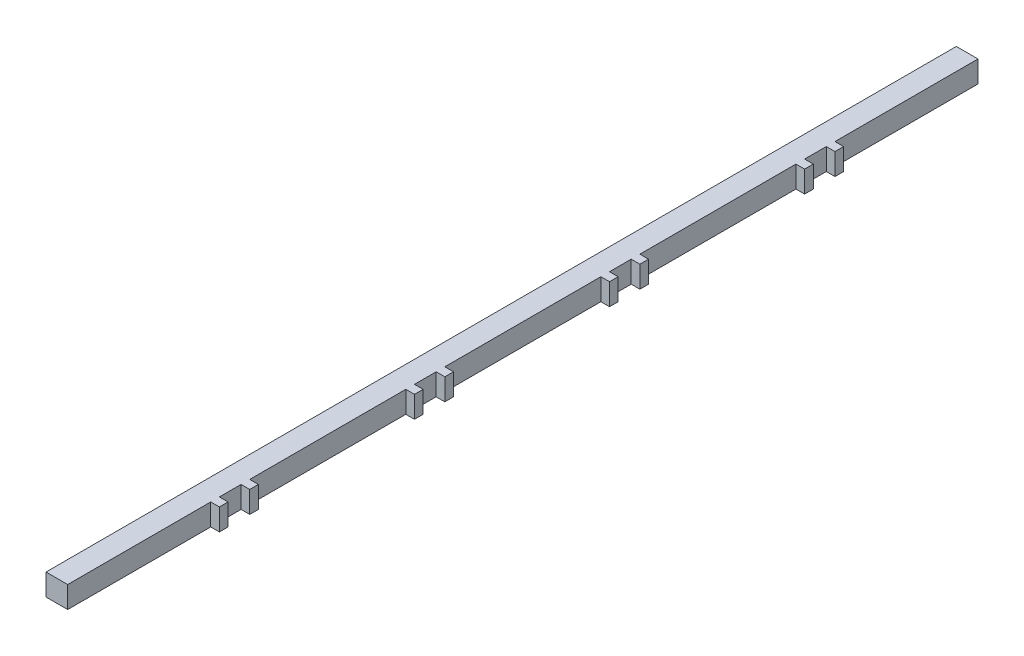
ISO-10303-21;
HEADER;
FILE_DESCRIPTION(('STEP AP214'),'2;1');
FILE_NAME('part.step','',(''),(''),'','','');
FILE_SCHEMA(('AUTOMOTIVE_DESIGN { 1 0 10303 214 1 1 1 1 }'));
ENDSEC;
DATA;
#1=APPLICATION_CONTEXT('core data for automotive mechanical design processes');
#2=APPLICATION_PROTOCOL_DEFINITION('international standard','automotive_design',2000,#1);
#3=PRODUCT_CONTEXT('',#1,'mechanical');
#4=PRODUCT('Part','Part','',(#3));
#5=PRODUCT_RELATED_PRODUCT_CATEGORY('part','',(#4));
#6=PRODUCT_DEFINITION_FORMATION('','',#4);
#7=PRODUCT_DEFINITION_CONTEXT('part definition',#1,'design');
#8=PRODUCT_DEFINITION('design','',#6,#7);
#9=PRODUCT_DEFINITION_SHAPE('','',#8);
#10=(LENGTH_UNIT() NAMED_UNIT(*) SI_UNIT(.MILLI.,.METRE.));
#11=(NAMED_UNIT(*) PLANE_ANGLE_UNIT() SI_UNIT($,.RADIAN.));
#12=(NAMED_UNIT(*) SI_UNIT($,.STERADIAN.) SOLID_ANGLE_UNIT());
#13=UNCERTAINTY_MEASURE_WITH_UNIT(LENGTH_MEASURE(1.E-05),#10,'distance_accuracy_value','');
#14=(GEOMETRIC_REPRESENTATION_CONTEXT(3) GLOBAL_UNCERTAINTY_ASSIGNED_CONTEXT((#13)) GLOBAL_UNIT_ASSIGNED_CONTEXT((#10,
#11,#12)) REPRESENTATION_CONTEXT('',''));
#15=CARTESIAN_POINT('',(0.,0.,0.));
#16=DIRECTION('',(0.,0.,1.));
#17=DIRECTION('',(1.,0.,0.));
#18=AXIS2_PLACEMENT_3D('',#15,#16,#17);
#19=CARTESIAN_POINT('',(0.,6.35,279.4));
#20=DIRECTION('',(-1.,0.,0.));
#21=DIRECTION('',(0.,0.,1.));
#22=AXIS2_PLACEMENT_3D('',#19,#20,#21);
#23=PLANE('',#22);
#24=DIRECTION('',(0.,-1.,0.));
#25=VECTOR('',#24,1.);
#26=CARTESIAN_POINT('',(0.,6.35,50.8));
#27=LINE('',#26,#25);
#28=CARTESIAN_POINT('',(0.,6.35,50.8));
#29=VERTEX_POINT('',#28);
#30=CARTESIAN_POINT('',(0.,0.,50.8));
#31=VERTEX_POINT('',#30);
#32=EDGE_CURVE('E599',#29,#31,#27,.T.);
#33=ORIENTED_EDGE('',*,*,#32,.F.);
#34=DIRECTION('',(0.,0.,-1.));
#35=VECTOR('',#34,1.);
#36=CARTESIAN_POINT('',(0.,6.35,279.4));
#37=LINE('',#36,#35);
#38=CARTESIAN_POINT('',(0.,6.35,57.15));
#39=VERTEX_POINT('',#38);
#40=EDGE_CURVE('E332',#39,#29,#37,.T.);
#41=ORIENTED_EDGE('',*,*,#40,.F.);
#42=DIRECTION('',(0.,1.,0.));
#43=VECTOR('',#42,1.);
#44=CARTESIAN_POINT('',(0.,0.,57.15));
#45=LINE('',#44,#43);
#46=CARTESIAN_POINT('',(0.,0.,57.15));
#47=VERTEX_POINT('',#46);
#48=EDGE_CURVE('E550',#47,#39,#45,.T.);
#49=ORIENTED_EDGE('',*,*,#48,.F.);
#50=DIRECTION('',(0.,0.,-1.));
#51=VECTOR('',#50,1.);
#52=CARTESIAN_POINT('',(0.,0.,279.4));
#53=LINE('',#52,#51);
#54=EDGE_CURVE('E310',#47,#31,#53,.T.);
#55=ORIENTED_EDGE('',*,*,#54,.T.);
#56=EDGE_LOOP('',(#33,#41,#49,#55));
#57=FACE_BOUND('',#56,.T.);
#58=ADVANCED_FACE('F45',(#57),#23,.F.);
#59=CARTESIAN_POINT('',(0.,0.,48.2600000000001));
#60=VERTEX_POINT('',#59);
#61=CARTESIAN_POINT('',(0.,0.,6.35));
#62=VERTEX_POINT('',#61);
#63=EDGE_CURVE('E301',#60,#62,#53,.T.);
#64=ORIENTED_EDGE('',*,*,#63,.T.);
#65=DIRECTION('',(0.,1.,0.));
#66=VECTOR('',#65,1.);
#67=CARTESIAN_POINT('',(0.,0.,6.35));
#68=LINE('',#67,#66);
#69=CARTESIAN_POINT('',(0.,6.35,6.35));
#70=VERTEX_POINT('',#69);
#71=EDGE_CURVE('E634',#62,#70,#68,.T.);
#72=ORIENTED_EDGE('',*,*,#71,.T.);
#73=CARTESIAN_POINT('',(0.,6.35,48.2600000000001));
#74=VERTEX_POINT('',#73);
#75=EDGE_CURVE('E322',#74,#70,#37,.T.);
#76=ORIENTED_EDGE('',*,*,#75,.F.);
#77=DIRECTION('',(0.,-1.,0.));
#78=VECTOR('',#77,1.);
#79=CARTESIAN_POINT('',(0.,6.35,48.2600000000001));
#80=LINE('',#79,#78);
#81=EDGE_CURVE('E594',#74,#60,#80,.T.);
#82=ORIENTED_EDGE('',*,*,#81,.T.);
#83=EDGE_LOOP('',(#64,#72,#76,#82));
#84=FACE_BOUND('',#83,.T.);
#85=ADVANCED_FACE('F646',(#84),#23,.F.);
#86=DIRECTION('',(0.,-1.,0.));
#87=VECTOR('',#86,1.);
#88=CARTESIAN_POINT('',(0.,6.35,107.95));
#89=LINE('',#88,#87);
#90=CARTESIAN_POINT('',(0.,6.35,107.95));
#91=VERTEX_POINT('',#90);
#92=CARTESIAN_POINT('',(0.,0.,107.95));
#93=VERTEX_POINT('',#92);
#94=EDGE_CURVE('E529',#91,#93,#89,.T.);
#95=ORIENTED_EDGE('',*,*,#94,.F.);
#96=CARTESIAN_POINT('',(0.,6.35,114.3));
#97=VERTEX_POINT('',#96);
#98=EDGE_CURVE('E744',#97,#91,#37,.T.);
#99=ORIENTED_EDGE('',*,*,#98,.F.);
#100=DIRECTION('',(0.,1.,0.));
#101=VECTOR('',#100,1.);
#102=CARTESIAN_POINT('',(0.,0.,114.3));
#103=LINE('',#102,#101);
#104=CARTESIAN_POINT('',(0.,0.,114.3));
#105=VERTEX_POINT('',#104);
#106=EDGE_CURVE('E480',#105,#97,#103,.T.);
#107=ORIENTED_EDGE('',*,*,#106,.F.);
#108=EDGE_CURVE('E683',#105,#93,#53,.T.);
#109=ORIENTED_EDGE('',*,*,#108,.T.);
#110=EDGE_LOOP('',(#95,#99,#107,#109));
#111=FACE_BOUND('',#110,.T.);
#112=ADVANCED_FACE('F774',(#111),#23,.F.);
#113=CARTESIAN_POINT('',(0.,0.,105.41));
#114=VERTEX_POINT('',#113);
#115=CARTESIAN_POINT('',(0.,0.,59.69));
#116=VERTEX_POINT('',#115);
#117=EDGE_CURVE('E320',#114,#116,#53,.T.);
#118=ORIENTED_EDGE('',*,*,#117,.T.);
#119=DIRECTION('',(0.,1.,0.));
#120=VECTOR('',#119,1.);
#121=CARTESIAN_POINT('',(0.,0.,59.69));
#122=LINE('',#121,#120);
#123=CARTESIAN_POINT('',(0.,6.35,59.69));
#124=VERTEX_POINT('',#123);
#125=EDGE_CURVE('E564',#116,#124,#122,.T.);
#126=ORIENTED_EDGE('',*,*,#125,.T.);
#127=CARTESIAN_POINT('',(0.,6.35,105.41));
#128=VERTEX_POINT('',#127);
#129=EDGE_CURVE('E341',#128,#124,#37,.T.);
#130=ORIENTED_EDGE('',*,*,#129,.F.);
#131=DIRECTION('',(0.,-1.,0.));
#132=VECTOR('',#131,1.);
#133=CARTESIAN_POINT('',(0.,6.35,105.41));
#134=LINE('',#133,#132);
#135=EDGE_CURVE('E524',#128,#114,#134,.T.);
#136=ORIENTED_EDGE('',*,*,#135,.T.);
#137=EDGE_LOOP('',(#118,#126,#130,#136));
#138=FACE_BOUND('',#137,.T.);
#139=ADVANCED_FACE('F757',(#138),#23,.F.);
#140=DIRECTION('',(0.,-1.,0.));
#141=VECTOR('',#140,1.);
#142=CARTESIAN_POINT('',(0.,6.35,165.1));
#143=LINE('',#142,#141);
#144=CARTESIAN_POINT('',(0.,6.35,165.1));
#145=VERTEX_POINT('',#144);
#146=CARTESIAN_POINT('',(0.,0.,165.1));
#147=VERTEX_POINT('',#146);
#148=EDGE_CURVE('E459',#145,#147,#143,.T.);
#149=ORIENTED_EDGE('',*,*,#148,.F.);
#150=CARTESIAN_POINT('',(0.,6.35,171.45));
#151=VERTEX_POINT('',#150);
#152=EDGE_CURVE('E735',#151,#145,#37,.T.);
#153=ORIENTED_EDGE('',*,*,#152,.F.);
#154=DIRECTION('',(0.,1.,0.));
#155=VECTOR('',#154,1.);
#156=CARTESIAN_POINT('',(0.,0.,171.45));
#157=LINE('',#156,#155);
#158=CARTESIAN_POINT('',(0.,0.,171.45));
#159=VERTEX_POINT('',#158);
#160=EDGE_CURVE('E419',#159,#151,#157,.T.);
#161=ORIENTED_EDGE('',*,*,#160,.F.);
#162=EDGE_CURVE('E697',#159,#147,#53,.T.);
#163=ORIENTED_EDGE('',*,*,#162,.T.);
#164=EDGE_LOOP('',(#149,#153,#161,#163));
#165=FACE_BOUND('',#164,.T.);
#166=ADVANCED_FACE('F736',(#165),#23,.F.);
#167=CARTESIAN_POINT('',(0.,0.,162.56));
#168=VERTEX_POINT('',#167);
#169=CARTESIAN_POINT('',(0.,0.,116.84));
#170=VERTEX_POINT('',#169);
#171=EDGE_CURVE('E688',#168,#170,#53,.T.);
#172=ORIENTED_EDGE('',*,*,#171,.T.);
#173=DIRECTION('',(0.,1.,0.));
#174=VECTOR('',#173,1.);
#175=CARTESIAN_POINT('',(0.,0.,116.84));
#176=LINE('',#175,#174);
#177=CARTESIAN_POINT('',(0.,6.35,116.84));
#178=VERTEX_POINT('',#177);
#179=EDGE_CURVE('E494',#170,#178,#176,.T.);
#180=ORIENTED_EDGE('',*,*,#179,.T.);
#181=CARTESIAN_POINT('',(0.,6.35,162.56));
#182=VERTEX_POINT('',#181);
#183=EDGE_CURVE('E738',#182,#178,#37,.T.);
#184=ORIENTED_EDGE('',*,*,#183,.F.);
#185=DIRECTION('',(0.,-1.,0.));
#186=VECTOR('',#185,1.);
#187=CARTESIAN_POINT('',(0.,6.35,162.56));
#188=LINE('',#187,#186);
#189=EDGE_CURVE('E454',#182,#168,#188,.T.);
#190=ORIENTED_EDGE('',*,*,#189,.T.);
#191=EDGE_LOOP('',(#172,#180,#184,#190));
#192=FACE_BOUND('',#191,.T.);
#193=ADVANCED_FACE('F797',(#192),#23,.F.);
#194=DIRECTION('',(0.,-1.,0.));
#195=VECTOR('',#194,1.);
#196=CARTESIAN_POINT('',(0.,6.35,222.25));
#197=LINE('',#196,#195);
#198=CARTESIAN_POINT('',(0.,6.35,222.25));
#199=VERTEX_POINT('',#198);
#200=CARTESIAN_POINT('',(0.,0.,222.25));
#201=VERTEX_POINT('',#200);
#202=EDGE_CURVE('E388',#199,#201,#197,.T.);
#203=ORIENTED_EDGE('',*,*,#202,.F.);
#204=CARTESIAN_POINT('',(0.,6.35,228.6));
#205=VERTEX_POINT('',#204);
#206=EDGE_CURVE('E321',#205,#199,#37,.T.);
#207=ORIENTED_EDGE('',*,*,#206,.F.);
#208=DIRECTION('',(0.,1.,0.));
#209=VECTOR('',#208,1.);
#210=CARTESIAN_POINT('',(0.,0.,228.6));
#211=LINE('',#210,#209);
#212=CARTESIAN_POINT('',(0.,0.,228.6));
#213=VERTEX_POINT('',#212);
#214=EDGE_CURVE('E367',#213,#205,#211,.T.);
#215=ORIENTED_EDGE('',*,*,#214,.F.);
#216=EDGE_CURVE('E300',#213,#201,#53,.T.);
#217=ORIENTED_EDGE('',*,*,#216,.T.);
#218=EDGE_LOOP('',(#203,#207,#215,#217));
#219=FACE_BOUND('',#218,.T.);
#220=ADVANCED_FACE('F792',(#219),#23,.F.);
#221=CARTESIAN_POINT('',(0.,0.,219.71));
#222=VERTEX_POINT('',#221);
#223=CARTESIAN_POINT('',(0.,0.,173.99));
#224=VERTEX_POINT('',#223);
#225=EDGE_CURVE('E306',#222,#224,#53,.T.);
#226=ORIENTED_EDGE('',*,*,#225,.T.);
#227=DIRECTION('',(0.,1.,0.));
#228=VECTOR('',#227,1.);
#229=CARTESIAN_POINT('',(0.,0.,173.99));
#230=LINE('',#229,#228);
#231=CARTESIAN_POINT('',(0.,6.35,173.99));
#232=VERTEX_POINT('',#231);
#233=EDGE_CURVE('E424',#224,#232,#230,.T.);
#234=ORIENTED_EDGE('',*,*,#233,.T.);
#235=CARTESIAN_POINT('',(0.,6.35,219.71));
#236=VERTEX_POINT('',#235);
#237=EDGE_CURVE('E328',#236,#232,#37,.T.);
#238=ORIENTED_EDGE('',*,*,#237,.F.);
#239=DIRECTION('',(0.,-1.,0.));
#240=VECTOR('',#239,1.);
#241=CARTESIAN_POINT('',(0.,6.35,219.71));
#242=LINE('',#241,#240);
#243=EDGE_CURVE('E371',#236,#222,#242,.T.);
#244=ORIENTED_EDGE('',*,*,#243,.T.);
#245=EDGE_LOOP('',(#226,#234,#238,#244));
#246=FACE_BOUND('',#245,.T.);
#247=ADVANCED_FACE('F716',(#246),#23,.F.);
#248=CARTESIAN_POINT('',(-6.35,6.35,279.4));
#249=DIRECTION('',(1.,0.,0.));
#250=DIRECTION('',(0.,0.,-1.));
#251=AXIS2_PLACEMENT_3D('',#248,#249,#250);
#252=PLANE('',#251);
#253=DIRECTION('',(0.,0.,-1.));
#254=VECTOR('',#253,1.);
#255=CARTESIAN_POINT('',(-6.35,0.,279.4));
#256=LINE('',#255,#254);
#257=CARTESIAN_POINT('',(-6.35,0.,273.05));
#258=VERTEX_POINT('',#257);
#259=CARTESIAN_POINT('',(-6.35,0.,6.35));
#260=VERTEX_POINT('',#259);
#261=EDGE_CURVE('E11',#258,#260,#256,.T.);
#262=ORIENTED_EDGE('',*,*,#261,.F.);
#263=DIRECTION('',(0.,1.,0.));
#264=VECTOR('',#263,1.);
#265=CARTESIAN_POINT('',(-6.35,0.,273.05));
#266=LINE('',#265,#264);
#267=CARTESIAN_POINT('',(-6.35,6.35,273.05));
#268=VERTEX_POINT('',#267);
#269=EDGE_CURVE('E280',#258,#268,#266,.T.);
#270=ORIENTED_EDGE('',*,*,#269,.T.);
#271=DIRECTION('',(0.,0.,-1.));
#272=VECTOR('',#271,1.);
#273=CARTESIAN_POINT('',(-6.35,6.35,279.4));
#274=LINE('',#273,#272);
#275=CARTESIAN_POINT('',(-6.35,6.35,6.35000000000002));
#276=VERTEX_POINT('',#275);
#277=EDGE_CURVE('E333',#268,#276,#274,.T.);
#278=ORIENTED_EDGE('',*,*,#277,.T.);
#279=DIRECTION('',(0.,1.,0.));
#280=VECTOR('',#279,1.);
#281=CARTESIAN_POINT('',(-6.35,0.,6.35));
#282=LINE('',#281,#280);
#283=EDGE_CURVE('E69',#260,#276,#282,.T.);
#284=ORIENTED_EDGE('',*,*,#283,.F.);
#285=EDGE_LOOP('',(#262,#270,#278,#284));
#286=FACE_BOUND('',#285,.T.);
#287=ADVANCED_FACE('F47',(#286),#252,.F.);
#288=CARTESIAN_POINT('',(0.,0.,279.4));
#289=DIRECTION('',(0.,1.,0.));
#290=DIRECTION('',(-1.,0.,0.));
#291=AXIS2_PLACEMENT_3D('',#288,#289,#290);
#292=PLANE('',#291);
#293=CARTESIAN_POINT('',(0.,0.,273.05));
#294=VERTEX_POINT('',#293);
#295=CARTESIAN_POINT('',(0.,0.,231.14));
#296=VERTEX_POINT('',#295);
#297=EDGE_CURVE('E54',#294,#296,#53,.T.);
#298=ORIENTED_EDGE('',*,*,#297,.F.);
#299=DIRECTION('',(-1.,0.,0.));
#300=VECTOR('',#299,1.);
#301=CARTESIAN_POINT('',(-6.35,0.,273.05));
#302=LINE('',#301,#300);
#303=EDGE_CURVE('E277',#294,#258,#302,.T.);
#304=ORIENTED_EDGE('',*,*,#303,.T.);
#305=ORIENTED_EDGE('',*,*,#261,.T.);
#306=DIRECTION('',(1.,0.,0.));
#307=VECTOR('',#306,1.);
#308=CARTESIAN_POINT('',(-6.35,0.,6.35));
#309=LINE('',#308,#307);
#310=EDGE_CURVE('E627',#260,#62,#309,.T.);
#311=ORIENTED_EDGE('',*,*,#310,.T.);
#312=ORIENTED_EDGE('',*,*,#63,.F.);
#313=DIRECTION('',(-1.,0.,0.));
#314=VECTOR('',#313,1.);
#315=CARTESIAN_POINT('',(2.54,0.,48.2600000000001));
#316=LINE('',#315,#314);
#317=CARTESIAN_POINT('',(2.54,0.,48.2600000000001));
#318=VERTEX_POINT('',#317);
#319=EDGE_CURVE('E622',#318,#60,#316,.T.);
#320=ORIENTED_EDGE('',*,*,#319,.F.);
#321=DIRECTION('',(0.,0.,-1.));
#322=VECTOR('',#321,1.);
#323=CARTESIAN_POINT('',(2.54,0.,50.8));
#324=LINE('',#323,#322);
#325=CARTESIAN_POINT('',(2.54,0.,50.8));
#326=VERTEX_POINT('',#325);
#327=EDGE_CURVE('E604',#326,#318,#324,.T.);
#328=ORIENTED_EDGE('',*,*,#327,.F.);
#329=DIRECTION('',(-1.,0.,0.));
#330=VECTOR('',#329,1.);
#331=CARTESIAN_POINT('',(2.54,0.,50.8));
#332=LINE('',#331,#330);
#333=EDGE_CURVE('E618',#326,#31,#332,.T.);
#334=ORIENTED_EDGE('',*,*,#333,.T.);
#335=ORIENTED_EDGE('',*,*,#54,.F.);
#336=DIRECTION('',(-1.,0.,0.));
#337=VECTOR('',#336,1.);
#338=CARTESIAN_POINT('',(2.54,0.,57.15));
#339=LINE('',#338,#337);
#340=CARTESIAN_POINT('',(2.54,0.,57.15));
#341=VERTEX_POINT('',#340);
#342=EDGE_CURVE('E591',#341,#47,#339,.T.);
#343=ORIENTED_EDGE('',*,*,#342,.F.);
#344=DIRECTION('',(0.,0.,-1.));
#345=VECTOR('',#344,1.);
#346=CARTESIAN_POINT('',(2.54,0.,59.69));
#347=LINE('',#346,#345);
#348=CARTESIAN_POINT('',(2.54,0.,59.69));
#349=VERTEX_POINT('',#348);
#350=EDGE_CURVE('E560',#349,#341,#347,.T.);
#351=ORIENTED_EDGE('',*,*,#350,.F.);
#352=DIRECTION('',(-1.,0.,0.));
#353=VECTOR('',#352,1.);
#354=CARTESIAN_POINT('',(2.54,0.,59.69));
#355=LINE('',#354,#353);
#356=EDGE_CURVE('E576',#349,#116,#355,.T.);
#357=ORIENTED_EDGE('',*,*,#356,.T.);
#358=ORIENTED_EDGE('',*,*,#117,.F.);
#359=DIRECTION('',(-1.,0.,0.));
#360=VECTOR('',#359,1.);
#361=CARTESIAN_POINT('',(2.54,0.,105.41));
#362=LINE('',#361,#360);
#363=CARTESIAN_POINT('',(2.54,0.,105.41));
#364=VERTEX_POINT('',#363);
#365=EDGE_CURVE('E554',#364,#114,#362,.T.);
#366=ORIENTED_EDGE('',*,*,#365,.F.);
#367=DIRECTION('',(0.,0.,-1.));
#368=VECTOR('',#367,1.);
#369=CARTESIAN_POINT('',(2.54,0.,107.95));
#370=LINE('',#369,#368);
#371=CARTESIAN_POINT('',(2.54,0.,107.95));
#372=VERTEX_POINT('',#371);
#373=EDGE_CURVE('E534',#372,#364,#370,.T.);
#374=ORIENTED_EDGE('',*,*,#373,.F.);
#375=DIRECTION('',(-1.,0.,0.));
#376=VECTOR('',#375,1.);
#377=CARTESIAN_POINT('',(2.54,0.,107.95));
#378=LINE('',#377,#376);
#379=EDGE_CURVE('E549',#372,#93,#378,.T.);
#380=ORIENTED_EDGE('',*,*,#379,.T.);
#381=ORIENTED_EDGE('',*,*,#108,.F.);
#382=DIRECTION('',(-1.,0.,0.));
#383=VECTOR('',#382,1.);
#384=CARTESIAN_POINT('',(2.54,0.,114.3));
#385=LINE('',#384,#383);
#386=CARTESIAN_POINT('',(2.54,0.,114.3));
#387=VERTEX_POINT('',#386);
#388=EDGE_CURVE('E521',#387,#105,#385,.T.);
#389=ORIENTED_EDGE('',*,*,#388,.F.);
#390=DIRECTION('',(0.,0.,-1.));
#391=VECTOR('',#390,1.);
#392=CARTESIAN_POINT('',(2.54,0.,116.84));
#393=LINE('',#392,#391);
#394=CARTESIAN_POINT('',(2.54,0.,116.84));
#395=VERTEX_POINT('',#394);
#396=EDGE_CURVE('E490',#395,#387,#393,.T.);
#397=ORIENTED_EDGE('',*,*,#396,.F.);
#398=DIRECTION('',(-1.,0.,0.));
#399=VECTOR('',#398,1.);
#400=CARTESIAN_POINT('',(2.54,0.,116.84));
#401=LINE('',#400,#399);
#402=EDGE_CURVE('E506',#395,#170,#401,.T.);
#403=ORIENTED_EDGE('',*,*,#402,.T.);
#404=ORIENTED_EDGE('',*,*,#171,.F.);
#405=DIRECTION('',(-1.,0.,0.));
#406=VECTOR('',#405,1.);
#407=CARTESIAN_POINT('',(2.54,0.,162.56));
#408=LINE('',#407,#406);
#409=CARTESIAN_POINT('',(2.54,0.,162.56));
#410=VERTEX_POINT('',#409);
#411=EDGE_CURVE('E484',#410,#168,#408,.T.);
#412=ORIENTED_EDGE('',*,*,#411,.F.);
#413=DIRECTION('',(0.,0.,-1.));
#414=VECTOR('',#413,1.);
#415=CARTESIAN_POINT('',(2.54,0.,165.1));
#416=LINE('',#415,#414);
#417=CARTESIAN_POINT('',(2.54,0.,165.1));
#418=VERTEX_POINT('',#417);
#419=EDGE_CURVE('E464',#418,#410,#416,.T.);
#420=ORIENTED_EDGE('',*,*,#419,.F.);
#421=DIRECTION('',(-1.,0.,0.));
#422=VECTOR('',#421,1.);
#423=CARTESIAN_POINT('',(2.54,0.,165.1));
#424=LINE('',#423,#422);
#425=EDGE_CURVE('E479',#418,#147,#424,.T.);
#426=ORIENTED_EDGE('',*,*,#425,.T.);
#427=ORIENTED_EDGE('',*,*,#162,.F.);
#428=DIRECTION('',(-1.,0.,0.));
#429=VECTOR('',#428,1.);
#430=CARTESIAN_POINT('',(2.54,0.,171.45));
#431=LINE('',#430,#429);
#432=CARTESIAN_POINT('',(2.54,0.,171.45));
#433=VERTEX_POINT('',#432);
#434=EDGE_CURVE('E451',#433,#159,#431,.T.);
#435=ORIENTED_EDGE('',*,*,#434,.F.);
#436=DIRECTION('',(0.,0.,-1.));
#437=VECTOR('',#436,1.);
#438=CARTESIAN_POINT('',(2.54,0.,173.99));
#439=LINE('',#438,#437);
#440=CARTESIAN_POINT('',(2.54,0.,173.99));
#441=VERTEX_POINT('',#440);
#442=EDGE_CURVE('E420',#441,#433,#439,.T.);
#443=ORIENTED_EDGE('',*,*,#442,.F.);
#444=DIRECTION('',(-1.,0.,0.));
#445=VECTOR('',#444,1.);
#446=CARTESIAN_POINT('',(2.54,0.,173.99));
#447=LINE('',#446,#445);
#448=EDGE_CURVE('E436',#441,#224,#447,.T.);
#449=ORIENTED_EDGE('',*,*,#448,.T.);
#450=ORIENTED_EDGE('',*,*,#225,.F.);
#451=DIRECTION('',(-1.,0.,0.));
#452=VECTOR('',#451,1.);
#453=CARTESIAN_POINT('',(2.54,0.,219.71));
#454=LINE('',#453,#452);
#455=CARTESIAN_POINT('',(2.54,0.,219.71));
#456=VERTEX_POINT('',#455);
#457=EDGE_CURVE('E416',#456,#222,#454,.T.);
#458=ORIENTED_EDGE('',*,*,#457,.F.);
#459=DIRECTION('',(0.,0.,-1.));
#460=VECTOR('',#459,1.);
#461=CARTESIAN_POINT('',(2.54,0.,222.25));
#462=LINE('',#461,#460);
#463=CARTESIAN_POINT('',(2.54,0.,222.25));
#464=VERTEX_POINT('',#463);
#465=EDGE_CURVE('E385',#464,#456,#462,.T.);
#466=ORIENTED_EDGE('',*,*,#465,.F.);
#467=DIRECTION('',(-1.,0.,0.));
#468=VECTOR('',#467,1.);
#469=CARTESIAN_POINT('',(2.54,0.,222.25));
#470=LINE('',#469,#468);
#471=EDGE_CURVE('E400',#464,#201,#470,.T.);
#472=ORIENTED_EDGE('',*,*,#471,.T.);
#473=ORIENTED_EDGE('',*,*,#216,.F.);
#474=DIRECTION('',(-1.,0.,0.));
#475=VECTOR('',#474,1.);
#476=CARTESIAN_POINT('',(2.54,0.,228.6));
#477=LINE('',#476,#475);
#478=CARTESIAN_POINT('',(2.54,0.,228.6));
#479=VERTEX_POINT('',#478);
#480=EDGE_CURVE('E343',#479,#213,#477,.T.);
#481=ORIENTED_EDGE('',*,*,#480,.F.);
#482=DIRECTION('',(0.,0.,-1.));
#483=VECTOR('',#482,1.);
#484=CARTESIAN_POINT('',(2.54,0.,231.14));
#485=LINE('',#484,#483);
#486=CARTESIAN_POINT('',(2.54,0.,231.14));
#487=VERTEX_POINT('',#486);
#488=EDGE_CURVE('E366',#487,#479,#485,.T.);
#489=ORIENTED_EDGE('',*,*,#488,.F.);
#490=DIRECTION('',(-1.,0.,0.));
#491=VECTOR('',#490,1.);
#492=CARTESIAN_POINT('',(2.54,0.,231.14));
#493=LINE('',#492,#491);
#494=EDGE_CURVE('E297',#487,#296,#493,.T.);
#495=ORIENTED_EDGE('',*,*,#494,.T.);
#496=EDGE_LOOP('',(#298,#304,#305,#311,#312,#320,#328,#334,#335,#343,#351,#357,#358,#366,#374,
#380,#381,#389,#397,#403,#404,#412,#420,#426,#427,#435,#443,#449,#450,#458,#466,#472,#473,#481,
#489,#495));
#497=FACE_BOUND('',#496,.T.);
#498=ADVANCED_FACE('F295',(#497),#292,.F.);
#499=CARTESIAN_POINT('',(0.,6.35,273.05));
#500=VERTEX_POINT('',#499);
#501=CARTESIAN_POINT('',(0.,6.35,231.14));
#502=VERTEX_POINT('',#501);
#503=EDGE_CURVE('E292',#500,#502,#37,.T.);
#504=ORIENTED_EDGE('',*,*,#503,.F.);
#505=DIRECTION('',(0.,1.,0.));
#506=VECTOR('',#505,1.);
#507=CARTESIAN_POINT('',(0.,0.,273.05));
#508=LINE('',#507,#506);
#509=EDGE_CURVE('E61',#294,#500,#508,.T.);
#510=ORIENTED_EDGE('',*,*,#509,.F.);
#511=ORIENTED_EDGE('',*,*,#297,.T.);
#512=DIRECTION('',(0.,1.,0.));
#513=VECTOR('',#512,1.);
#514=CARTESIAN_POINT('',(0.,0.,231.14));
#515=LINE('',#514,#513);
#516=EDGE_CURVE('E363',#296,#502,#515,.T.);
#517=ORIENTED_EDGE('',*,*,#516,.T.);
#518=EDGE_LOOP('',(#504,#510,#511,#517));
#519=FACE_BOUND('',#518,.T.);
#520=ADVANCED_FACE('F289',(#519),#23,.F.);
#521=CARTESIAN_POINT('',(-6.35,6.35,279.4));
#522=DIRECTION('',(0.,-1.,0.));
#523=DIRECTION('',(0.,0.,-1.));
#524=AXIS2_PLACEMENT_3D('',#521,#522,#523);
#525=PLANE('',#524);
#526=ORIENTED_EDGE('',*,*,#277,.F.);
#527=DIRECTION('',(-1.,0.,0.));
#528=VECTOR('',#527,1.);
#529=CARTESIAN_POINT('',(-6.35,6.35,273.05));
#530=LINE('',#529,#528);
#531=EDGE_CURVE('E285',#500,#268,#530,.T.);
#532=ORIENTED_EDGE('',*,*,#531,.F.);
#533=ORIENTED_EDGE('',*,*,#503,.T.);
#534=DIRECTION('',(-1.,0.,0.));
#535=VECTOR('',#534,1.);
#536=CARTESIAN_POINT('',(2.54,6.35,231.14));
#537=LINE('',#536,#535);
#538=CARTESIAN_POINT('',(2.54,6.35,231.14));
#539=VERTEX_POINT('',#538);
#540=EDGE_CURVE('E356',#539,#502,#537,.T.);
#541=ORIENTED_EDGE('',*,*,#540,.F.);
#542=DIRECTION('',(0.,0.,-1.));
#543=VECTOR('',#542,1.);
#544=CARTESIAN_POINT('',(2.54,6.35,231.14));
#545=LINE('',#544,#543);
#546=CARTESIAN_POINT('',(2.54,6.35,228.6));
#547=VERTEX_POINT('',#546);
#548=EDGE_CURVE('E375',#539,#547,#545,.T.);
#549=ORIENTED_EDGE('',*,*,#548,.T.);
#550=DIRECTION('',(-1.,0.,0.));
#551=VECTOR('',#550,1.);
#552=CARTESIAN_POINT('',(2.54,6.35,228.6));
#553=LINE('',#552,#551);
#554=EDGE_CURVE('E350',#547,#205,#553,.T.);
#555=ORIENTED_EDGE('',*,*,#554,.T.);
#556=ORIENTED_EDGE('',*,*,#206,.T.);
#557=DIRECTION('',(-1.,0.,0.));
#558=VECTOR('',#557,1.);
#559=CARTESIAN_POINT('',(2.54,6.35,222.25));
#560=LINE('',#559,#558);
#561=CARTESIAN_POINT('',(2.54,6.35,222.25));
#562=VERTEX_POINT('',#561);
#563=EDGE_CURVE('E409',#562,#199,#560,.T.);
#564=ORIENTED_EDGE('',*,*,#563,.F.);
#565=DIRECTION('',(0.,0.,-1.));
#566=VECTOR('',#565,1.);
#567=CARTESIAN_POINT('',(2.54,6.35,222.25));
#568=LINE('',#567,#566);
#569=CARTESIAN_POINT('',(2.54,6.35,219.71));
#570=VERTEX_POINT('',#569);
#571=EDGE_CURVE('E393',#562,#570,#568,.T.);
#572=ORIENTED_EDGE('',*,*,#571,.T.);
#573=DIRECTION('',(-1.,0.,0.));
#574=VECTOR('',#573,1.);
#575=CARTESIAN_POINT('',(2.54,6.35,219.71));
#576=LINE('',#575,#574);
#577=EDGE_CURVE('E412',#570,#236,#576,.T.);
#578=ORIENTED_EDGE('',*,*,#577,.T.);
#579=ORIENTED_EDGE('',*,*,#237,.T.);
#580=DIRECTION('',(-1.,0.,0.));
#581=VECTOR('',#580,1.);
#582=CARTESIAN_POINT('',(2.54,6.35,173.99));
#583=LINE('',#582,#581);
#584=CARTESIAN_POINT('',(2.54,6.35,173.99));
#585=VERTEX_POINT('',#584);
#586=EDGE_CURVE('E444',#585,#232,#583,.T.);
#587=ORIENTED_EDGE('',*,*,#586,.F.);
#588=DIRECTION('',(0.,0.,-1.));
#589=VECTOR('',#588,1.);
#590=CARTESIAN_POINT('',(2.54,6.35,173.99));
#591=LINE('',#590,#589);
#592=CARTESIAN_POINT('',(2.54,6.35,171.45));
#593=VERTEX_POINT('',#592);
#594=EDGE_CURVE('E428',#585,#593,#591,.T.);
#595=ORIENTED_EDGE('',*,*,#594,.T.);
#596=DIRECTION('',(-1.,0.,0.));
#597=VECTOR('',#596,1.);
#598=CARTESIAN_POINT('',(2.54,6.35,171.45));
#599=LINE('',#598,#597);
#600=EDGE_CURVE('E447',#593,#151,#599,.T.);
#601=ORIENTED_EDGE('',*,*,#600,.T.);
#602=ORIENTED_EDGE('',*,*,#152,.T.);
#603=DIRECTION('',(-1.,0.,0.));
#604=VECTOR('',#603,1.);
#605=CARTESIAN_POINT('',(2.54,6.35,165.1));
#606=LINE('',#605,#604);
#607=CARTESIAN_POINT('',(2.54,6.35,165.1));
#608=VERTEX_POINT('',#607);
#609=EDGE_CURVE('E476',#608,#145,#606,.T.);
#610=ORIENTED_EDGE('',*,*,#609,.F.);
#611=DIRECTION('',(0.,0.,-1.));
#612=VECTOR('',#611,1.);
#613=CARTESIAN_POINT('',(2.54,6.35,165.1));
#614=LINE('',#613,#612);
#615=CARTESIAN_POINT('',(2.54,6.35,162.56));
#616=VERTEX_POINT('',#615);
#617=EDGE_CURVE('E455',#608,#616,#614,.T.);
#618=ORIENTED_EDGE('',*,*,#617,.T.);
#619=DIRECTION('',(-1.,0.,0.));
#620=VECTOR('',#619,1.);
#621=CARTESIAN_POINT('',(2.54,6.35,162.56));
#622=LINE('',#621,#620);
#623=EDGE_CURVE('E470',#616,#182,#622,.T.);
#624=ORIENTED_EDGE('',*,*,#623,.T.);
#625=ORIENTED_EDGE('',*,*,#183,.T.);
#626=DIRECTION('',(-1.,0.,0.));
#627=VECTOR('',#626,1.);
#628=CARTESIAN_POINT('',(2.54,6.35,116.84));
#629=LINE('',#628,#627);
#630=CARTESIAN_POINT('',(2.54,6.35,116.84));
#631=VERTEX_POINT('',#630);
#632=EDGE_CURVE('E514',#631,#178,#629,.T.);
#633=ORIENTED_EDGE('',*,*,#632,.F.);
#634=DIRECTION('',(0.,0.,-1.));
#635=VECTOR('',#634,1.);
#636=CARTESIAN_POINT('',(2.54,6.35,116.84));
#637=LINE('',#636,#635);
#638=CARTESIAN_POINT('',(2.54,6.35,114.3));
#639=VERTEX_POINT('',#638);
#640=EDGE_CURVE('E498',#631,#639,#637,.T.);
#641=ORIENTED_EDGE('',*,*,#640,.T.);
#642=DIRECTION('',(-1.,0.,0.));
#643=VECTOR('',#642,1.);
#644=CARTESIAN_POINT('',(2.54,6.35,114.3));
#645=LINE('',#644,#643);
#646=EDGE_CURVE('E517',#639,#97,#645,.T.);
#647=ORIENTED_EDGE('',*,*,#646,.T.);
#648=ORIENTED_EDGE('',*,*,#98,.T.);
#649=DIRECTION('',(-1.,0.,0.));
#650=VECTOR('',#649,1.);
#651=CARTESIAN_POINT('',(2.54,6.35,107.95));
#652=LINE('',#651,#650);
#653=CARTESIAN_POINT('',(2.54,6.35,107.95));
#654=VERTEX_POINT('',#653);
#655=EDGE_CURVE('E546',#654,#91,#652,.T.);
#656=ORIENTED_EDGE('',*,*,#655,.F.);
#657=DIRECTION('',(0.,0.,-1.));
#658=VECTOR('',#657,1.);
#659=CARTESIAN_POINT('',(2.54,6.35,107.95));
#660=LINE('',#659,#658);
#661=CARTESIAN_POINT('',(2.54,6.35,105.41));
#662=VERTEX_POINT('',#661);
#663=EDGE_CURVE('E525',#654,#662,#660,.T.);
#664=ORIENTED_EDGE('',*,*,#663,.T.);
#665=DIRECTION('',(-1.,0.,0.));
#666=VECTOR('',#665,1.);
#667=CARTESIAN_POINT('',(2.54,6.35,105.41));
#668=LINE('',#667,#666);
#669=EDGE_CURVE('E540',#662,#128,#668,.T.);
#670=ORIENTED_EDGE('',*,*,#669,.T.);
#671=ORIENTED_EDGE('',*,*,#129,.T.);
#672=DIRECTION('',(-1.,0.,0.));
#673=VECTOR('',#672,1.);
#674=CARTESIAN_POINT('',(2.54,6.35,59.69));
#675=LINE('',#674,#673);
#676=CARTESIAN_POINT('',(2.54,6.35,59.69));
#677=VERTEX_POINT('',#676);
#678=EDGE_CURVE('E584',#677,#124,#675,.T.);
#679=ORIENTED_EDGE('',*,*,#678,.F.);
#680=DIRECTION('',(0.,0.,-1.));
#681=VECTOR('',#680,1.);
#682=CARTESIAN_POINT('',(2.54,6.35,59.69));
#683=LINE('',#682,#681);
#684=CARTESIAN_POINT('',(2.54,6.35,57.15));
#685=VERTEX_POINT('',#684);
#686=EDGE_CURVE('E568',#677,#685,#683,.T.);
#687=ORIENTED_EDGE('',*,*,#686,.T.);
#688=DIRECTION('',(-1.,0.,0.));
#689=VECTOR('',#688,1.);
#690=CARTESIAN_POINT('',(2.54,6.35,57.15));
#691=LINE('',#690,#689);
#692=EDGE_CURVE('E587',#685,#39,#691,.T.);
#693=ORIENTED_EDGE('',*,*,#692,.T.);
#694=ORIENTED_EDGE('',*,*,#40,.T.);
#695=DIRECTION('',(-1.,0.,0.));
#696=VECTOR('',#695,1.);
#697=CARTESIAN_POINT('',(2.54,6.35,50.8));
#698=LINE('',#697,#696);
#699=CARTESIAN_POINT('',(2.54,6.35,50.8));
#700=VERTEX_POINT('',#699);
#701=EDGE_CURVE('E615',#700,#29,#698,.T.);
#702=ORIENTED_EDGE('',*,*,#701,.F.);
#703=DIRECTION('',(0.,0.,-1.));
#704=VECTOR('',#703,1.);
#705=CARTESIAN_POINT('',(2.54,6.35,50.8));
#706=LINE('',#705,#704);
#707=CARTESIAN_POINT('',(2.54,6.35,48.2600000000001));
#708=VERTEX_POINT('',#707);
#709=EDGE_CURVE('E595',#700,#708,#706,.T.);
#710=ORIENTED_EDGE('',*,*,#709,.T.);
#711=DIRECTION('',(-1.,0.,0.));
#712=VECTOR('',#711,1.);
#713=CARTESIAN_POINT('',(2.54,6.35,48.2600000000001));
#714=LINE('',#713,#712);
#715=EDGE_CURVE('E610',#708,#74,#714,.T.);
#716=ORIENTED_EDGE('',*,*,#715,.T.);
#717=ORIENTED_EDGE('',*,*,#75,.T.);
#718=DIRECTION('',(1.,0.,0.));
#719=VECTOR('',#718,1.);
#720=CARTESIAN_POINT('',(-6.35,6.35,6.35));
#721=LINE('',#720,#719);
#722=EDGE_CURVE('E631',#276,#70,#721,.T.);
#723=ORIENTED_EDGE('',*,*,#722,.F.);
#724=EDGE_LOOP('',(#526,#532,#533,#541,#549,#555,#556,#564,#572,#578,#579,#587,#595,#601,#602,
#610,#618,#624,#625,#633,#641,#647,#648,#656,#664,#670,#671,#679,#687,#693,#694,#702,#710,#716,
#717,#723));
#725=FACE_BOUND('',#724,.T.);
#726=ADVANCED_FACE('F644',(#725),#525,.F.);
#727=CARTESIAN_POINT('',(2.54,0.,228.6));
#728=DIRECTION('',(0.,0.,1.));
#729=DIRECTION('',(1.,0.,0.));
#730=AXIS2_PLACEMENT_3D('',#727,#728,#729);
#731=PLANE('',#730);
#732=ORIENTED_EDGE('',*,*,#214,.T.);
#733=ORIENTED_EDGE('',*,*,#554,.F.);
#734=DIRECTION('',(0.,1.,0.));
#735=VECTOR('',#734,1.);
#736=CARTESIAN_POINT('',(2.54,0.,228.6));
#737=LINE('',#736,#735);
#738=EDGE_CURVE('E379',#479,#547,#737,.T.);
#739=ORIENTED_EDGE('',*,*,#738,.F.);
#740=ORIENTED_EDGE('',*,*,#480,.T.);
#741=EDGE_LOOP('',(#732,#733,#739,#740));
#742=FACE_BOUND('',#741,.T.);
#743=ADVANCED_FACE('F790',(#742),#731,.F.);
#744=CARTESIAN_POINT('',(2.54,0.,231.14));
#745=DIRECTION('',(0.,0.,1.));
#746=DIRECTION('',(1.,0.,0.));
#747=AXIS2_PLACEMENT_3D('',#744,#745,#746);
#748=PLANE('',#747);
#749=ORIENTED_EDGE('',*,*,#516,.F.);
#750=ORIENTED_EDGE('',*,*,#494,.F.);
#751=DIRECTION('',(0.,1.,0.));
#752=VECTOR('',#751,1.);
#753=CARTESIAN_POINT('',(2.54,0.,231.14));
#754=LINE('',#753,#752);
#755=EDGE_CURVE('E362',#487,#539,#754,.T.);
#756=ORIENTED_EDGE('',*,*,#755,.T.);
#757=ORIENTED_EDGE('',*,*,#540,.T.);
#758=EDGE_LOOP('',(#749,#750,#756,#757));
#759=FACE_BOUND('',#758,.T.);
#760=ADVANCED_FACE('F826',(#759),#748,.T.);
#761=CARTESIAN_POINT('',(2.54,0.,0.));
#762=DIRECTION('',(1.,0.,0.));
#763=DIRECTION('',(0.,0.,-1.));
#764=AXIS2_PLACEMENT_3D('',#761,#762,#763);
#765=PLANE('',#764);
#766=ORIENTED_EDGE('',*,*,#488,.T.);
#767=ORIENTED_EDGE('',*,*,#738,.T.);
#768=ORIENTED_EDGE('',*,*,#548,.F.);
#769=ORIENTED_EDGE('',*,*,#755,.F.);
#770=EDGE_LOOP('',(#766,#767,#768,#769));
#771=FACE_BOUND('',#770,.T.);
#772=ADVANCED_FACE('F819',(#771),#765,.T.);
#773=CARTESIAN_POINT('',(2.54,6.35,219.71));
#774=DIRECTION('',(0.,0.,-1.));
#775=DIRECTION('',(-1.,0.,0.));
#776=AXIS2_PLACEMENT_3D('',#773,#774,#775);
#777=PLANE('',#776);
#778=ORIENTED_EDGE('',*,*,#243,.F.);
#779=ORIENTED_EDGE('',*,*,#577,.F.);
#780=DIRECTION('',(0.,-1.,0.));
#781=VECTOR('',#780,1.);
#782=CARTESIAN_POINT('',(2.54,6.35,219.71));
#783=LINE('',#782,#781);
#784=EDGE_CURVE('E389',#570,#456,#783,.T.);
#785=ORIENTED_EDGE('',*,*,#784,.T.);
#786=ORIENTED_EDGE('',*,*,#457,.T.);
#787=EDGE_LOOP('',(#778,#779,#785,#786));
#788=FACE_BOUND('',#787,.T.);
#789=ADVANCED_FACE('F817',(#788),#777,.T.);
#790=CARTESIAN_POINT('',(2.54,6.35,222.25));
#791=DIRECTION('',(0.,0.,-1.));
#792=DIRECTION('',(-1.,0.,0.));
#793=AXIS2_PLACEMENT_3D('',#790,#791,#792);
#794=PLANE('',#793);
#795=ORIENTED_EDGE('',*,*,#202,.T.);
#796=ORIENTED_EDGE('',*,*,#471,.F.);
#797=DIRECTION('',(0.,-1.,0.));
#798=VECTOR('',#797,1.);
#799=CARTESIAN_POINT('',(2.54,6.35,222.25));
#800=LINE('',#799,#798);
#801=EDGE_CURVE('E397',#562,#464,#800,.T.);
#802=ORIENTED_EDGE('',*,*,#801,.F.);
#803=ORIENTED_EDGE('',*,*,#563,.T.);
#804=EDGE_LOOP('',(#795,#796,#802,#803));
#805=FACE_BOUND('',#804,.T.);
#806=ADVANCED_FACE('F811',(#805),#794,.F.);
#807=CARTESIAN_POINT('',(2.54,0.,0.));
#808=DIRECTION('',(-1.,0.,0.));
#809=DIRECTION('',(0.,0.,1.));
#810=AXIS2_PLACEMENT_3D('',#807,#808,#809);
#811=PLANE('',#810);
#812=ORIENTED_EDGE('',*,*,#465,.T.);
#813=ORIENTED_EDGE('',*,*,#784,.F.);
#814=ORIENTED_EDGE('',*,*,#571,.F.);
#815=ORIENTED_EDGE('',*,*,#801,.T.);
#816=EDGE_LOOP('',(#812,#813,#814,#815));
#817=FACE_BOUND('',#816,.T.);
#818=ADVANCED_FACE('F815',(#817),#811,.F.);
#819=CARTESIAN_POINT('',(2.54,0.,171.45));
#820=DIRECTION('',(0.,0.,1.));
#821=DIRECTION('',(1.,0.,0.));
#822=AXIS2_PLACEMENT_3D('',#819,#820,#821);
#823=PLANE('',#822);
#824=ORIENTED_EDGE('',*,*,#160,.T.);
#825=ORIENTED_EDGE('',*,*,#600,.F.);
#826=DIRECTION('',(0.,1.,0.));
#827=VECTOR('',#826,1.);
#828=CARTESIAN_POINT('',(2.54,0.,171.45));
#829=LINE('',#828,#827);
#830=EDGE_CURVE('E425',#433,#593,#829,.T.);
#831=ORIENTED_EDGE('',*,*,#830,.F.);
#832=ORIENTED_EDGE('',*,*,#434,.T.);
#833=EDGE_LOOP('',(#824,#825,#831,#832));
#834=FACE_BOUND('',#833,.T.);
#835=ADVANCED_FACE('F732',(#834),#823,.F.);
#836=CARTESIAN_POINT('',(2.54,0.,173.99));
#837=DIRECTION('',(0.,0.,1.));
#838=DIRECTION('',(1.,0.,0.));
#839=AXIS2_PLACEMENT_3D('',#836,#837,#838);
#840=PLANE('',#839);
#841=ORIENTED_EDGE('',*,*,#233,.F.);
#842=ORIENTED_EDGE('',*,*,#448,.F.);
#843=DIRECTION('',(0.,1.,0.));
#844=VECTOR('',#843,1.);
#845=CARTESIAN_POINT('',(2.54,0.,173.99));
#846=LINE('',#845,#844);
#847=EDGE_CURVE('E432',#441,#585,#846,.T.);
#848=ORIENTED_EDGE('',*,*,#847,.T.);
#849=ORIENTED_EDGE('',*,*,#586,.T.);
#850=EDGE_LOOP('',(#841,#842,#848,#849));
#851=FACE_BOUND('',#850,.T.);
#852=ADVANCED_FACE('F726',(#851),#840,.T.);
#853=CARTESIAN_POINT('',(2.54,0.,0.));
#854=DIRECTION('',(1.,0.,0.));
#855=DIRECTION('',(0.,0.,-1.));
#856=AXIS2_PLACEMENT_3D('',#853,#854,#855);
#857=PLANE('',#856);
#858=ORIENTED_EDGE('',*,*,#442,.T.);
#859=ORIENTED_EDGE('',*,*,#830,.T.);
#860=ORIENTED_EDGE('',*,*,#594,.F.);
#861=ORIENTED_EDGE('',*,*,#847,.F.);
#862=EDGE_LOOP('',(#858,#859,#860,#861));
#863=FACE_BOUND('',#862,.T.);
#864=ADVANCED_FACE('F729',(#863),#857,.T.);
#865=CARTESIAN_POINT('',(2.54,6.35,165.1));
#866=DIRECTION('',(0.,0.,-1.));
#867=DIRECTION('',(-1.,0.,0.));
#868=AXIS2_PLACEMENT_3D('',#865,#866,#867);
#869=PLANE('',#868);
#870=ORIENTED_EDGE('',*,*,#148,.T.);
#871=ORIENTED_EDGE('',*,*,#425,.F.);
#872=DIRECTION('',(0.,-1.,0.));
#873=VECTOR('',#872,1.);
#874=CARTESIAN_POINT('',(2.54,6.35,165.1));
#875=LINE('',#874,#873);
#876=EDGE_CURVE('E467',#608,#418,#875,.T.);
#877=ORIENTED_EDGE('',*,*,#876,.F.);
#878=ORIENTED_EDGE('',*,*,#609,.T.);
#879=EDGE_LOOP('',(#870,#871,#877,#878));
#880=FACE_BOUND('',#879,.T.);
#881=ADVANCED_FACE('F896',(#880),#869,.F.);
#882=CARTESIAN_POINT('',(2.54,6.35,162.56));
#883=DIRECTION('',(0.,0.,-1.));
#884=DIRECTION('',(-1.,0.,0.));
#885=AXIS2_PLACEMENT_3D('',#882,#883,#884);
#886=PLANE('',#885);
#887=ORIENTED_EDGE('',*,*,#189,.F.);
#888=ORIENTED_EDGE('',*,*,#623,.F.);
#889=DIRECTION('',(0.,-1.,0.));
#890=VECTOR('',#889,1.);
#891=CARTESIAN_POINT('',(2.54,6.35,162.56));
#892=LINE('',#891,#890);
#893=EDGE_CURVE('E460',#616,#410,#892,.T.);
#894=ORIENTED_EDGE('',*,*,#893,.T.);
#895=ORIENTED_EDGE('',*,*,#411,.T.);
#896=EDGE_LOOP('',(#887,#888,#894,#895));
#897=FACE_BOUND('',#896,.T.);
#898=ADVANCED_FACE('F905',(#897),#886,.T.);
#899=CARTESIAN_POINT('',(2.54,0.,0.));
#900=DIRECTION('',(-1.,0.,0.));
#901=DIRECTION('',(0.,0.,1.));
#902=AXIS2_PLACEMENT_3D('',#899,#900,#901);
#903=PLANE('',#902);
#904=ORIENTED_EDGE('',*,*,#617,.F.);
#905=ORIENTED_EDGE('',*,*,#876,.T.);
#906=ORIENTED_EDGE('',*,*,#419,.T.);
#907=ORIENTED_EDGE('',*,*,#893,.F.);
#908=EDGE_LOOP('',(#904,#905,#906,#907));
#909=FACE_BOUND('',#908,.T.);
#910=ADVANCED_FACE('F916',(#909),#903,.F.);
#911=CARTESIAN_POINT('',(2.54,0.,114.3));
#912=DIRECTION('',(0.,0.,1.));
#913=DIRECTION('',(1.,0.,0.));
#914=AXIS2_PLACEMENT_3D('',#911,#912,#913);
#915=PLANE('',#914);
#916=ORIENTED_EDGE('',*,*,#106,.T.);
#917=ORIENTED_EDGE('',*,*,#646,.F.);
#918=DIRECTION('',(0.,1.,0.));
#919=VECTOR('',#918,1.);
#920=CARTESIAN_POINT('',(2.54,0.,114.3));
#921=LINE('',#920,#919);
#922=EDGE_CURVE('E495',#387,#639,#921,.T.);
#923=ORIENTED_EDGE('',*,*,#922,.F.);
#924=ORIENTED_EDGE('',*,*,#388,.T.);
#925=EDGE_LOOP('',(#916,#917,#923,#924));
#926=FACE_BOUND('',#925,.T.);
#927=ADVANCED_FACE('F772',(#926),#915,.F.);
#928=CARTESIAN_POINT('',(2.54,0.,116.84));
#929=DIRECTION('',(0.,0.,1.));
#930=DIRECTION('',(1.,0.,0.));
#931=AXIS2_PLACEMENT_3D('',#928,#929,#930);
#932=PLANE('',#931);
#933=ORIENTED_EDGE('',*,*,#179,.F.);
#934=ORIENTED_EDGE('',*,*,#402,.F.);
#935=DIRECTION('',(0.,1.,0.));
#936=VECTOR('',#935,1.);
#937=CARTESIAN_POINT('',(2.54,0.,116.84));
#938=LINE('',#937,#936);
#939=EDGE_CURVE('E502',#395,#631,#938,.T.);
#940=ORIENTED_EDGE('',*,*,#939,.T.);
#941=ORIENTED_EDGE('',*,*,#632,.T.);
#942=EDGE_LOOP('',(#933,#934,#940,#941));
#943=FACE_BOUND('',#942,.T.);
#944=ADVANCED_FACE('F937',(#943),#932,.T.);
#945=CARTESIAN_POINT('',(2.54,0.,0.));
#946=DIRECTION('',(1.,0.,0.));
#947=DIRECTION('',(0.,0.,-1.));
#948=AXIS2_PLACEMENT_3D('',#945,#946,#947);
#949=PLANE('',#948);
#950=ORIENTED_EDGE('',*,*,#396,.T.);
#951=ORIENTED_EDGE('',*,*,#922,.T.);
#952=ORIENTED_EDGE('',*,*,#640,.F.);
#953=ORIENTED_EDGE('',*,*,#939,.F.);
#954=EDGE_LOOP('',(#950,#951,#952,#953));
#955=FACE_BOUND('',#954,.T.);
#956=ADVANCED_FACE('F947',(#955),#949,.T.);
#957=CARTESIAN_POINT('',(2.54,6.35,107.95));
#958=DIRECTION('',(0.,0.,-1.));
#959=DIRECTION('',(-1.,0.,0.));
#960=AXIS2_PLACEMENT_3D('',#957,#958,#959);
#961=PLANE('',#960);
#962=ORIENTED_EDGE('',*,*,#94,.T.);
#963=ORIENTED_EDGE('',*,*,#379,.F.);
#964=DIRECTION('',(0.,-1.,0.));
#965=VECTOR('',#964,1.);
#966=CARTESIAN_POINT('',(2.54,6.35,107.95));
#967=LINE('',#966,#965);
#968=EDGE_CURVE('E537',#654,#372,#967,.T.);
#969=ORIENTED_EDGE('',*,*,#968,.F.);
#970=ORIENTED_EDGE('',*,*,#655,.T.);
#971=EDGE_LOOP('',(#962,#963,#969,#970));
#972=FACE_BOUND('',#971,.T.);
#973=ADVANCED_FACE('F767',(#972),#961,.F.);
#974=CARTESIAN_POINT('',(2.54,6.35,105.41));
#975=DIRECTION('',(0.,0.,-1.));
#976=DIRECTION('',(-1.,0.,0.));
#977=AXIS2_PLACEMENT_3D('',#974,#975,#976);
#978=PLANE('',#977);
#979=ORIENTED_EDGE('',*,*,#135,.F.);
#980=ORIENTED_EDGE('',*,*,#669,.F.);
#981=DIRECTION('',(0.,-1.,0.));
#982=VECTOR('',#981,1.);
#983=CARTESIAN_POINT('',(2.54,6.35,105.41));
#984=LINE('',#983,#982);
#985=EDGE_CURVE('E530',#662,#364,#984,.T.);
#986=ORIENTED_EDGE('',*,*,#985,.T.);
#987=ORIENTED_EDGE('',*,*,#365,.T.);
#988=EDGE_LOOP('',(#979,#980,#986,#987));
#989=FACE_BOUND('',#988,.T.);
#990=ADVANCED_FACE('F759',(#989),#978,.T.);
#991=CARTESIAN_POINT('',(2.54,0.,0.));
#992=DIRECTION('',(-1.,0.,0.));
#993=DIRECTION('',(0.,0.,1.));
#994=AXIS2_PLACEMENT_3D('',#991,#992,#993);
#995=PLANE('',#994);
#996=ORIENTED_EDGE('',*,*,#663,.F.);
#997=ORIENTED_EDGE('',*,*,#968,.T.);
#998=ORIENTED_EDGE('',*,*,#373,.T.);
#999=ORIENTED_EDGE('',*,*,#985,.F.);
#1000=EDGE_LOOP('',(#996,#997,#998,#999));
#1001=FACE_BOUND('',#1000,.T.);
#1002=ADVANCED_FACE('F763',(#1001),#995,.F.);
#1003=CARTESIAN_POINT('',(2.54,0.,57.15));
#1004=DIRECTION('',(0.,0.,1.));
#1005=DIRECTION('',(1.,0.,0.));
#1006=AXIS2_PLACEMENT_3D('',#1003,#1004,#1005);
#1007=PLANE('',#1006);
#1008=ORIENTED_EDGE('',*,*,#48,.T.);
#1009=ORIENTED_EDGE('',*,*,#692,.F.);
#1010=DIRECTION('',(0.,1.,0.));
#1011=VECTOR('',#1010,1.);
#1012=CARTESIAN_POINT('',(2.54,0.,57.15));
#1013=LINE('',#1012,#1011);
#1014=EDGE_CURVE('E565',#341,#685,#1013,.T.);
#1015=ORIENTED_EDGE('',*,*,#1014,.F.);
#1016=ORIENTED_EDGE('',*,*,#342,.T.);
#1017=EDGE_LOOP('',(#1008,#1009,#1015,#1016));
#1018=FACE_BOUND('',#1017,.T.);
#1019=ADVANCED_FACE('F667',(#1018),#1007,.F.);
#1020=CARTESIAN_POINT('',(2.54,0.,59.69));
#1021=DIRECTION('',(0.,0.,1.));
#1022=DIRECTION('',(1.,0.,0.));
#1023=AXIS2_PLACEMENT_3D('',#1020,#1021,#1022);
#1024=PLANE('',#1023);
#1025=ORIENTED_EDGE('',*,*,#125,.F.);
#1026=ORIENTED_EDGE('',*,*,#356,.F.);
#1027=DIRECTION('',(0.,1.,0.));
#1028=VECTOR('',#1027,1.);
#1029=CARTESIAN_POINT('',(2.54,0.,59.69));
#1030=LINE('',#1029,#1028);
#1031=EDGE_CURVE('E572',#349,#677,#1030,.T.);
#1032=ORIENTED_EDGE('',*,*,#1031,.T.);
#1033=ORIENTED_EDGE('',*,*,#678,.T.);
#1034=EDGE_LOOP('',(#1025,#1026,#1032,#1033));
#1035=FACE_BOUND('',#1034,.T.);
#1036=ADVANCED_FACE('F675',(#1035),#1024,.T.);
#1037=CARTESIAN_POINT('',(2.54,0.,0.));
#1038=DIRECTION('',(1.,0.,0.));
#1039=DIRECTION('',(0.,0.,-1.));
#1040=AXIS2_PLACEMENT_3D('',#1037,#1038,#1039);
#1041=PLANE('',#1040);
#1042=ORIENTED_EDGE('',*,*,#350,.T.);
#1043=ORIENTED_EDGE('',*,*,#1014,.T.);
#1044=ORIENTED_EDGE('',*,*,#686,.F.);
#1045=ORIENTED_EDGE('',*,*,#1031,.F.);
#1046=EDGE_LOOP('',(#1042,#1043,#1044,#1045));
#1047=FACE_BOUND('',#1046,.T.);
#1048=ADVANCED_FACE('F672',(#1047),#1041,.T.);
#1049=CARTESIAN_POINT('',(2.54,6.35,50.8));
#1050=DIRECTION('',(0.,0.,-1.));
#1051=DIRECTION('',(-1.,0.,0.));
#1052=AXIS2_PLACEMENT_3D('',#1049,#1050,#1051);
#1053=PLANE('',#1052);
#1054=ORIENTED_EDGE('',*,*,#32,.T.);
#1055=ORIENTED_EDGE('',*,*,#333,.F.);
#1056=DIRECTION('',(0.,-1.,0.));
#1057=VECTOR('',#1056,1.);
#1058=CARTESIAN_POINT('',(2.54,6.35,50.8));
#1059=LINE('',#1058,#1057);
#1060=EDGE_CURVE('E607',#700,#326,#1059,.T.);
#1061=ORIENTED_EDGE('',*,*,#1060,.F.);
#1062=ORIENTED_EDGE('',*,*,#701,.T.);
#1063=EDGE_LOOP('',(#1054,#1055,#1061,#1062));
#1064=FACE_BOUND('',#1063,.T.);
#1065=ADVANCED_FACE('F660',(#1064),#1053,.F.);
#1066=CARTESIAN_POINT('',(2.54,6.35,48.2600000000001));
#1067=DIRECTION('',(0.,0.,-1.));
#1068=DIRECTION('',(-1.,0.,0.));
#1069=AXIS2_PLACEMENT_3D('',#1066,#1067,#1068);
#1070=PLANE('',#1069);
#1071=ORIENTED_EDGE('',*,*,#81,.F.);
#1072=ORIENTED_EDGE('',*,*,#715,.F.);
#1073=DIRECTION('',(0.,-1.,0.));
#1074=VECTOR('',#1073,1.);
#1075=CARTESIAN_POINT('',(2.54,6.35,48.2600000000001));
#1076=LINE('',#1075,#1074);
#1077=EDGE_CURVE('E600',#708,#318,#1076,.T.);
#1078=ORIENTED_EDGE('',*,*,#1077,.T.);
#1079=ORIENTED_EDGE('',*,*,#319,.T.);
#1080=EDGE_LOOP('',(#1071,#1072,#1078,#1079));
#1081=FACE_BOUND('',#1080,.T.);
#1082=ADVANCED_FACE('F651',(#1081),#1070,.T.);
#1083=CARTESIAN_POINT('',(2.54,0.,0.));
#1084=DIRECTION('',(-1.,0.,0.));
#1085=DIRECTION('',(0.,0.,1.));
#1086=AXIS2_PLACEMENT_3D('',#1083,#1084,#1085);
#1087=PLANE('',#1086);
#1088=ORIENTED_EDGE('',*,*,#709,.F.);
#1089=ORIENTED_EDGE('',*,*,#1060,.T.);
#1090=ORIENTED_EDGE('',*,*,#327,.T.);
#1091=ORIENTED_EDGE('',*,*,#1077,.F.);
#1092=EDGE_LOOP('',(#1088,#1089,#1090,#1091));
#1093=FACE_BOUND('',#1092,.T.);
#1094=ADVANCED_FACE('F654',(#1093),#1087,.F.);
#1095=CARTESIAN_POINT('',(-6.35,0.,6.35));
#1096=DIRECTION('',(0.,0.,1.));
#1097=DIRECTION('',(1.,0.,0.));
#1098=AXIS2_PLACEMENT_3D('',#1095,#1096,#1097);
#1099=PLANE('',#1098);
#1100=ORIENTED_EDGE('',*,*,#722,.T.);
#1101=ORIENTED_EDGE('',*,*,#71,.F.);
#1102=ORIENTED_EDGE('',*,*,#310,.F.);
#1103=ORIENTED_EDGE('',*,*,#283,.T.);
#1104=EDGE_LOOP('',(#1100,#1101,#1102,#1103));
#1105=FACE_BOUND('',#1104,.T.);
#1106=ADVANCED_FACE('F645',(#1105),#1099,.F.);
#1107=CARTESIAN_POINT('',(-6.35,0.,273.05));
#1108=DIRECTION('',(0.,0.,-1.));
#1109=DIRECTION('',(-1.,0.,0.));
#1110=AXIS2_PLACEMENT_3D('',#1107,#1108,#1109);
#1111=PLANE('',#1110);
#1112=ORIENTED_EDGE('',*,*,#531,.T.);
#1113=ORIENTED_EDGE('',*,*,#269,.F.);
#1114=ORIENTED_EDGE('',*,*,#303,.F.);
#1115=ORIENTED_EDGE('',*,*,#509,.T.);
#1116=EDGE_LOOP('',(#1112,#1113,#1114,#1115));
#1117=FACE_BOUND('',#1116,.T.);
#1118=ADVANCED_FACE('F278',(#1117),#1111,.F.);
#1119=CLOSED_SHELL('',(#58,#85,#112,#139,#166,#193,#220,#247,#287,#498,#520,#726,#743,#760,#772,
#789,#806,#818,#835,#852,#864,#881,#898,#910,#927,#944,#956,#973,#990,#1002,#1019,#1036,#1048,
#1065,#1082,#1094,#1106,#1118));
#1120=MANIFOLD_SOLID_BREP('B2',#1119);
#1121=ADVANCED_BREP_SHAPE_REPRESENTATION('',(#18,#1120),#14);
#1122=SHAPE_DEFINITION_REPRESENTATION(#9,#1121);
ENDSEC;
END-ISO-10303-21;
